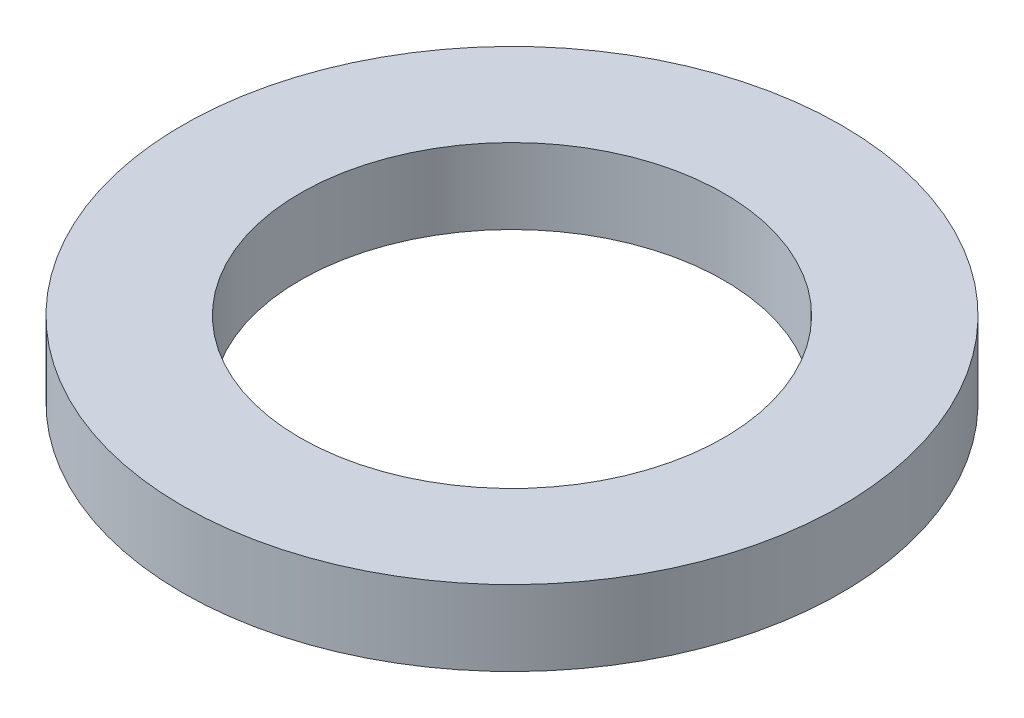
ISO-10303-21;
HEADER;
FILE_DESCRIPTION(('STEP AP214'),'2;1');
FILE_NAME('part.step','',(''),(''),'','','');
FILE_SCHEMA(('AUTOMOTIVE_DESIGN { 1 0 10303 214 1 1 1 1 }'));
ENDSEC;
DATA;
#1=APPLICATION_CONTEXT('core data for automotive mechanical design processes');
#2=APPLICATION_PROTOCOL_DEFINITION('international standard','automotive_design',2000,#1);
#3=PRODUCT_CONTEXT('',#1,'mechanical');
#4=PRODUCT('Part','Part','',(#3));
#5=PRODUCT_RELATED_PRODUCT_CATEGORY('part','',(#4));
#6=PRODUCT_DEFINITION_FORMATION('','',#4);
#7=PRODUCT_DEFINITION_CONTEXT('part definition',#1,'design');
#8=PRODUCT_DEFINITION('design','',#6,#7);
#9=PRODUCT_DEFINITION_SHAPE('','',#8);
#10=(LENGTH_UNIT() NAMED_UNIT(*) SI_UNIT(.MILLI.,.METRE.));
#11=(NAMED_UNIT(*) PLANE_ANGLE_UNIT() SI_UNIT($,.RADIAN.));
#12=(NAMED_UNIT(*) SI_UNIT($,.STERADIAN.) SOLID_ANGLE_UNIT());
#13=UNCERTAINTY_MEASURE_WITH_UNIT(LENGTH_MEASURE(1.E-05),#10,'distance_accuracy_value','');
#14=(GEOMETRIC_REPRESENTATION_CONTEXT(3) GLOBAL_UNCERTAINTY_ASSIGNED_CONTEXT((#13)) GLOBAL_UNIT_ASSIGNED_CONTEXT((#10,
#11,#12)) REPRESENTATION_CONTEXT('',''));
#15=CARTESIAN_POINT('',(0.,0.,0.));
#16=DIRECTION('',(0.,0.,1.));
#17=DIRECTION('',(1.,0.,0.));
#18=AXIS2_PLACEMENT_3D('',#15,#16,#17);
#19=CARTESIAN_POINT('',(0.,0.,0.));
#20=DIRECTION('',(0.,1.,0.));
#21=DIRECTION('',(0.,0.,1.));
#22=AXIS2_PLACEMENT_3D('',#19,#20,#21);
#23=CYLINDRICAL_SURFACE('',#22,4.5);
#24=CARTESIAN_POINT('',(0.,0.,0.));
#25=DIRECTION('',(0.,1.,0.));
#26=DIRECTION('',(0.,0.,1.));
#27=AXIS2_PLACEMENT_3D('',#24,#25,#26);
#28=CIRCLE('',#27,4.5);
#29=CARTESIAN_POINT('',(0.,0.,4.5));
#30=VERTEX_POINT('',#29);
#31=EDGE_CURVE('E10',#30,#30,#28,.T.);
#32=ORIENTED_EDGE('',*,*,#31,.T.);
#33=EDGE_LOOP('',(#32));
#34=FACE_BOUND('',#33,.T.);
#35=CARTESIAN_POINT('',(0.,-1.6,0.));
#36=DIRECTION('',(0.,1.,0.));
#37=DIRECTION('',(0.,0.,1.));
#38=AXIS2_PLACEMENT_3D('',#35,#36,#37);
#39=CIRCLE('',#38,4.5);
#40=CARTESIAN_POINT('',(0.,-1.6,4.5));
#41=VERTEX_POINT('',#40);
#42=EDGE_CURVE('E44',#41,#41,#39,.T.);
#43=ORIENTED_EDGE('',*,*,#42,.F.);
#44=EDGE_LOOP('',(#43));
#45=FACE_BOUND('',#44,.T.);
#46=ADVANCED_FACE('F30',(#34,#45),#23,.F.);
#47=CARTESIAN_POINT('',(4.5,0.,0.));
#48=DIRECTION('',(0.,1.,0.));
#49=DIRECTION('',(0.,0.,1.));
#50=AXIS2_PLACEMENT_3D('',#47,#48,#49);
#51=PLANE('',#50);
#52=CARTESIAN_POINT('',(0.,0.,0.));
#53=DIRECTION('',(0.,1.,0.));
#54=DIRECTION('',(0.,0.,1.));
#55=AXIS2_PLACEMENT_3D('',#52,#53,#54);
#56=CIRCLE('',#55,7.);
#57=CARTESIAN_POINT('',(0.,0.,7.));
#58=VERTEX_POINT('',#57);
#59=EDGE_CURVE('E36',#58,#58,#56,.T.);
#60=ORIENTED_EDGE('',*,*,#59,.T.);
#61=EDGE_LOOP('',(#60));
#62=FACE_BOUND('',#61,.T.);
#63=ORIENTED_EDGE('',*,*,#31,.F.);
#64=EDGE_LOOP('',(#63));
#65=FACE_BOUND('',#64,.T.);
#66=ADVANCED_FACE('F54',(#62,#65),#51,.T.);
#67=CARTESIAN_POINT('',(0.,0.,0.));
#68=DIRECTION('',(0.,1.,0.));
#69=DIRECTION('',(0.,0.,1.));
#70=AXIS2_PLACEMENT_3D('',#67,#68,#69);
#71=CYLINDRICAL_SURFACE('',#70,7.);
#72=CARTESIAN_POINT('',(0.,-1.6,0.));
#73=DIRECTION('',(0.,1.,0.));
#74=DIRECTION('',(0.,0.,1.));
#75=AXIS2_PLACEMENT_3D('',#72,#73,#74);
#76=CIRCLE('',#75,7.);
#77=CARTESIAN_POINT('',(0.,-1.6,7.));
#78=VERTEX_POINT('',#77);
#79=EDGE_CURVE('E40',#78,#78,#76,.T.);
#80=ORIENTED_EDGE('',*,*,#79,.T.);
#81=EDGE_LOOP('',(#80));
#82=FACE_BOUND('',#81,.T.);
#83=ORIENTED_EDGE('',*,*,#59,.F.);
#84=EDGE_LOOP('',(#83));
#85=FACE_BOUND('',#84,.T.);
#86=ADVANCED_FACE('F58',(#82,#85),#71,.T.);
#87=CARTESIAN_POINT('',(4.5,-1.6,0.));
#88=DIRECTION('',(0.,-1.,0.));
#89=DIRECTION('',(0.,0.,-1.));
#90=AXIS2_PLACEMENT_3D('',#87,#88,#89);
#91=PLANE('',#90);
#92=ORIENTED_EDGE('',*,*,#42,.T.);
#93=EDGE_LOOP('',(#92));
#94=FACE_BOUND('',#93,.T.);
#95=ORIENTED_EDGE('',*,*,#79,.F.);
#96=EDGE_LOOP('',(#95));
#97=FACE_BOUND('',#96,.T.);
#98=ADVANCED_FACE('F50',(#94,#97),#91,.T.);
#99=CLOSED_SHELL('',(#46,#66,#86,#98));
#100=MANIFOLD_SOLID_BREP('B2',#99);
#101=ADVANCED_BREP_SHAPE_REPRESENTATION('',(#18,#100),#14);
#102=SHAPE_DEFINITION_REPRESENTATION(#9,#101);
ENDSEC;
END-ISO-10303-21;
